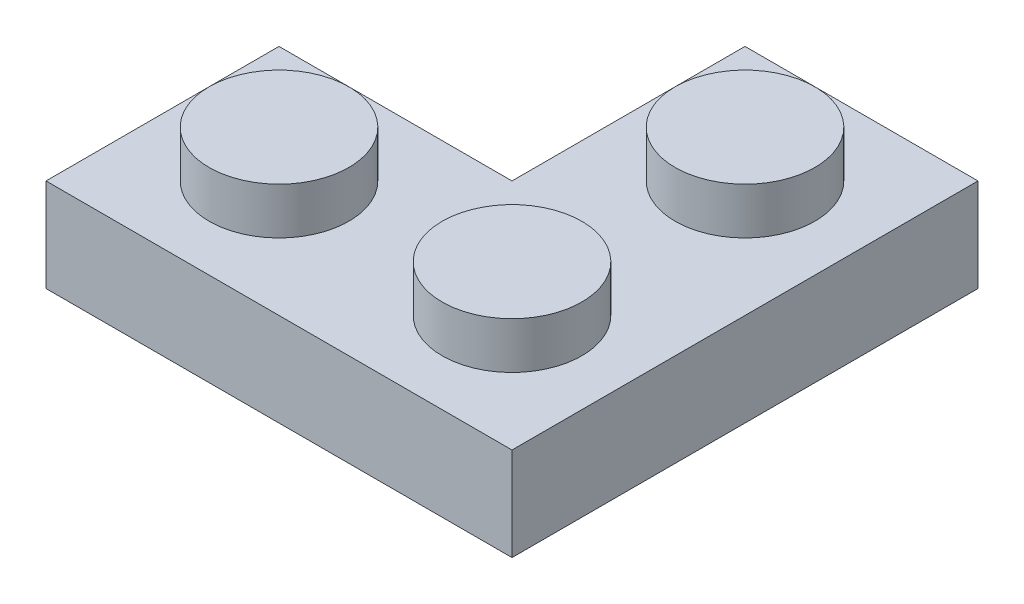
ISO-10303-21;
HEADER;
FILE_DESCRIPTION(('STEP AP214'),'2;1');
FILE_NAME('part.step','',(''),(''),'','','');
FILE_SCHEMA(('AUTOMOTIVE_DESIGN { 1 0 10303 214 1 1 1 1 }'));
ENDSEC;
DATA;
#1=APPLICATION_CONTEXT('core data for automotive mechanical design processes');
#2=APPLICATION_PROTOCOL_DEFINITION('international standard','automotive_design',2000,#1);
#3=PRODUCT_CONTEXT('',#1,'mechanical');
#4=PRODUCT('Part','Part','',(#3));
#5=PRODUCT_RELATED_PRODUCT_CATEGORY('part','',(#4));
#6=PRODUCT_DEFINITION_FORMATION('','',#4);
#7=PRODUCT_DEFINITION_CONTEXT('part definition',#1,'design');
#8=PRODUCT_DEFINITION('design','',#6,#7);
#9=PRODUCT_DEFINITION_SHAPE('','',#8);
#10=(LENGTH_UNIT() NAMED_UNIT(*) SI_UNIT(.MILLI.,.METRE.));
#11=(NAMED_UNIT(*) PLANE_ANGLE_UNIT() SI_UNIT($,.RADIAN.));
#12=(NAMED_UNIT(*) SI_UNIT($,.STERADIAN.) SOLID_ANGLE_UNIT());
#13=UNCERTAINTY_MEASURE_WITH_UNIT(LENGTH_MEASURE(1.E-05),#10,'distance_accuracy_value','');
#14=(GEOMETRIC_REPRESENTATION_CONTEXT(3) GLOBAL_UNCERTAINTY_ASSIGNED_CONTEXT((#13)) GLOBAL_UNIT_ASSIGNED_CONTEXT((#10,
#11,#12)) REPRESENTATION_CONTEXT('',''));
#15=CARTESIAN_POINT('',(0.,0.,0.));
#16=DIRECTION('',(0.,0.,1.));
#17=DIRECTION('',(1.,0.,0.));
#18=AXIS2_PLACEMENT_3D('',#15,#16,#17);
#19=CARTESIAN_POINT('',(0.,0.,-8.));
#20=DIRECTION('',(0.,-1.,0.));
#21=DIRECTION('',(0.,0.,-1.));
#22=AXIS2_PLACEMENT_3D('',#19,#20,#21);
#23=PLANE('',#22);
#24=DIRECTION('',(1.,0.,0.));
#25=VECTOR('',#24,1.);
#26=CARTESIAN_POINT('',(0.,0.,0.));
#27=LINE('',#26,#25);
#28=CARTESIAN_POINT('',(0.,0.,0.));
#29=VERTEX_POINT('',#28);
#30=CARTESIAN_POINT('',(16.,0.,0.));
#31=VERTEX_POINT('',#30);
#32=EDGE_CURVE('E247',#29,#31,#27,.T.);
#33=ORIENTED_EDGE('',*,*,#32,.F.);
#34=DIRECTION('',(0.,0.,1.));
#35=VECTOR('',#34,1.);
#36=CARTESIAN_POINT('',(0.,0.,-8.));
#37=LINE('',#36,#35);
#38=CARTESIAN_POINT('',(0.,0.,-8.));
#39=VERTEX_POINT('',#38);
#40=EDGE_CURVE('E244',#39,#29,#37,.T.);
#41=ORIENTED_EDGE('',*,*,#40,.F.);
#42=DIRECTION('',(1.,0.,0.));
#43=VECTOR('',#42,1.);
#44=CARTESIAN_POINT('',(0.,0.,-8.));
#45=LINE('',#44,#43);
#46=CARTESIAN_POINT('',(8.,0.,-8.));
#47=VERTEX_POINT('',#46);
#48=EDGE_CURVE('E238',#39,#47,#45,.T.);
#49=ORIENTED_EDGE('',*,*,#48,.T.);
#50=DIRECTION('',(0.,0.,-1.));
#51=VECTOR('',#50,1.);
#52=CARTESIAN_POINT('',(8.,0.,-8.));
#53=LINE('',#52,#51);
#54=CARTESIAN_POINT('',(8.,0.,-16.));
#55=VERTEX_POINT('',#54);
#56=EDGE_CURVE('E61',#47,#55,#53,.T.);
#57=ORIENTED_EDGE('',*,*,#56,.T.);
#58=DIRECTION('',(1.,0.,0.));
#59=VECTOR('',#58,1.);
#60=CARTESIAN_POINT('',(8.,0.,-16.));
#61=LINE('',#60,#59);
#62=CARTESIAN_POINT('',(16.,0.,-16.));
#63=VERTEX_POINT('',#62);
#64=EDGE_CURVE('E226',#55,#63,#61,.T.);
#65=ORIENTED_EDGE('',*,*,#64,.T.);
#66=DIRECTION('',(0.,0.,1.));
#67=VECTOR('',#66,1.);
#68=CARTESIAN_POINT('',(16.,0.,-8.));
#69=LINE('',#68,#67);
#70=EDGE_CURVE('E259',#63,#31,#69,.T.);
#71=ORIENTED_EDGE('',*,*,#70,.T.);
#72=EDGE_LOOP('',(#33,#41,#49,#57,#65,#71));
#73=FACE_BOUND('',#72,.T.);
#74=DIRECTION('',(0.,0.,1.));
#75=VECTOR('',#74,1.);
#76=CARTESIAN_POINT('',(1.6,0.,-8.));
#77=LINE('',#76,#75);
#78=CARTESIAN_POINT('',(1.6,0.,-6.4));
#79=VERTEX_POINT('',#78);
#80=CARTESIAN_POINT('',(1.6,0.,-1.6));
#81=VERTEX_POINT('',#80);
#82=EDGE_CURVE('E172',#79,#81,#77,.T.);
#83=ORIENTED_EDGE('',*,*,#82,.T.);
#84=DIRECTION('',(1.,0.,0.));
#85=VECTOR('',#84,1.);
#86=CARTESIAN_POINT('',(0.,0.,-1.6));
#87=LINE('',#86,#85);
#88=CARTESIAN_POINT('',(14.4,0.,-1.6));
#89=VERTEX_POINT('',#88);
#90=EDGE_CURVE('E148',#81,#89,#87,.T.);
#91=ORIENTED_EDGE('',*,*,#90,.T.);
#92=DIRECTION('',(0.,0.,1.));
#93=VECTOR('',#92,1.);
#94=CARTESIAN_POINT('',(14.4,0.,-8.));
#95=LINE('',#94,#93);
#96=CARTESIAN_POINT('',(14.4,0.,-14.4));
#97=VERTEX_POINT('',#96);
#98=EDGE_CURVE('E164',#97,#89,#95,.T.);
#99=ORIENTED_EDGE('',*,*,#98,.F.);
#100=DIRECTION('',(1.,0.,0.));
#101=VECTOR('',#100,1.);
#102=CARTESIAN_POINT('',(0.,0.,-14.4));
#103=LINE('',#102,#101);
#104=CARTESIAN_POINT('',(9.6,0.,-14.4));
#105=VERTEX_POINT('',#104);
#106=EDGE_CURVE('E166',#105,#97,#103,.T.);
#107=ORIENTED_EDGE('',*,*,#106,.F.);
#108=DIRECTION('',(0.,0.,-1.));
#109=VECTOR('',#108,1.);
#110=CARTESIAN_POINT('',(9.6,0.,0.));
#111=LINE('',#110,#109);
#112=CARTESIAN_POINT('',(9.6,0.,-6.4));
#113=VERTEX_POINT('',#112);
#114=EDGE_CURVE('E179',#113,#105,#111,.T.);
#115=ORIENTED_EDGE('',*,*,#114,.F.);
#116=DIRECTION('',(1.,0.,0.));
#117=VECTOR('',#116,1.);
#118=CARTESIAN_POINT('',(0.,0.,-6.4));
#119=LINE('',#118,#117);
#120=EDGE_CURVE('E156',#79,#113,#119,.T.);
#121=ORIENTED_EDGE('',*,*,#120,.F.);
#122=EDGE_LOOP('',(#83,#91,#99,#107,#115,#121));
#123=FACE_BOUND('',#122,.T.);
#124=ADVANCED_FACE('F38',(#73,#123),#23,.T.);
#125=CARTESIAN_POINT('',(0.,3.2,-8.));
#126=DIRECTION('',(-1.,0.,0.));
#127=DIRECTION('',(0.,0.,1.));
#128=AXIS2_PLACEMENT_3D('',#125,#126,#127);
#129=PLANE('',#128);
#130=DIRECTION('',(0.,-1.,0.));
#131=VECTOR('',#130,1.);
#132=CARTESIAN_POINT('',(0.,3.2,0.));
#133=LINE('',#132,#131);
#134=CARTESIAN_POINT('',(0.,3.2,0.));
#135=VERTEX_POINT('',#134);
#136=EDGE_CURVE('E232',#135,#29,#133,.T.);
#137=ORIENTED_EDGE('',*,*,#136,.F.);
#138=DIRECTION('',(0.,0.,1.));
#139=VECTOR('',#138,1.);
#140=CARTESIAN_POINT('',(0.,3.2,-8.));
#141=LINE('',#140,#139);
#142=CARTESIAN_POINT('',(0.,3.2,-8.));
#143=VERTEX_POINT('',#142);
#144=EDGE_CURVE('E255',#143,#135,#141,.T.);
#145=ORIENTED_EDGE('',*,*,#144,.F.);
#146=DIRECTION('',(0.,-1.,0.));
#147=VECTOR('',#146,1.);
#148=CARTESIAN_POINT('',(0.,3.2,-8.));
#149=LINE('',#148,#147);
#150=EDGE_CURVE('E235',#143,#39,#149,.T.);
#151=ORIENTED_EDGE('',*,*,#150,.T.);
#152=ORIENTED_EDGE('',*,*,#40,.T.);
#153=EDGE_LOOP('',(#137,#145,#151,#152));
#154=FACE_BOUND('',#153,.T.);
#155=ADVANCED_FACE('F40',(#154),#129,.T.);
#156=CARTESIAN_POINT('',(16.,3.2,-8.));
#157=DIRECTION('',(0.,1.,0.));
#158=DIRECTION('',(-1.,0.,0.));
#159=AXIS2_PLACEMENT_3D('',#156,#157,#158);
#160=PLANE('',#159);
#161=CARTESIAN_POINT('',(4.,3.2,-4.));
#162=DIRECTION('',(0.,1.,0.));
#163=DIRECTION('',(-1.,0.,0.));
#164=AXIS2_PLACEMENT_3D('',#161,#162,#163);
#165=CIRCLE('',#164,2.4);
#166=CARTESIAN_POINT('',(1.6,3.2,-4.));
#167=VERTEX_POINT('',#166);
#168=EDGE_CURVE('E139',#167,#167,#165,.T.);
#169=ORIENTED_EDGE('',*,*,#168,.F.);
#170=EDGE_LOOP('',(#169));
#171=FACE_BOUND('',#170,.T.);
#172=CARTESIAN_POINT('',(12.,3.2,-4.));
#173=DIRECTION('',(0.,1.,0.));
#174=DIRECTION('',(-1.,0.,0.));
#175=AXIS2_PLACEMENT_3D('',#172,#173,#174);
#176=CIRCLE('',#175,2.4);
#177=CARTESIAN_POINT('',(9.6,3.2,-4.));
#178=VERTEX_POINT('',#177);
#179=EDGE_CURVE('E202',#178,#178,#176,.T.);
#180=ORIENTED_EDGE('',*,*,#179,.F.);
#181=EDGE_LOOP('',(#180));
#182=FACE_BOUND('',#181,.T.);
#183=CARTESIAN_POINT('',(12.,3.2,-12.));
#184=DIRECTION('',(0.,1.,0.));
#185=DIRECTION('',(-1.,0.,0.));
#186=AXIS2_PLACEMENT_3D('',#183,#184,#185);
#187=CIRCLE('',#186,2.4);
#188=CARTESIAN_POINT('',(9.6,3.2,-12.));
#189=VERTEX_POINT('',#188);
#190=EDGE_CURVE('E208',#189,#189,#187,.T.);
#191=ORIENTED_EDGE('',*,*,#190,.F.);
#192=EDGE_LOOP('',(#191));
#193=FACE_BOUND('',#192,.T.);
#194=DIRECTION('',(-1.,0.,0.));
#195=VECTOR('',#194,1.);
#196=CARTESIAN_POINT('',(16.,3.2,0.));
#197=LINE('',#196,#195);
#198=CARTESIAN_POINT('',(16.,3.2,0.));
#199=VERTEX_POINT('',#198);
#200=EDGE_CURVE('E239',#199,#135,#197,.T.);
#201=ORIENTED_EDGE('',*,*,#200,.F.);
#202=DIRECTION('',(0.,0.,1.));
#203=VECTOR('',#202,1.);
#204=CARTESIAN_POINT('',(16.,3.2,-8.));
#205=LINE('',#204,#203);
#206=CARTESIAN_POINT('',(16.,3.2,-16.));
#207=VERTEX_POINT('',#206);
#208=EDGE_CURVE('E257',#207,#199,#205,.T.);
#209=ORIENTED_EDGE('',*,*,#208,.F.);
#210=DIRECTION('',(1.,0.,0.));
#211=VECTOR('',#210,1.);
#212=CARTESIAN_POINT('',(8.,3.2,-16.));
#213=LINE('',#212,#211);
#214=CARTESIAN_POINT('',(8.,3.2,-16.));
#215=VERTEX_POINT('',#214);
#216=EDGE_CURVE('E229',#215,#207,#213,.T.);
#217=ORIENTED_EDGE('',*,*,#216,.F.);
#218=DIRECTION('',(0.,0.,1.));
#219=VECTOR('',#218,1.);
#220=CARTESIAN_POINT('',(8.,3.2,-8.));
#221=LINE('',#220,#219);
#222=CARTESIAN_POINT('',(8.,3.2,-8.));
#223=VERTEX_POINT('',#222);
#224=EDGE_CURVE('E223',#215,#223,#221,.T.);
#225=ORIENTED_EDGE('',*,*,#224,.T.);
#226=DIRECTION('',(-1.,0.,0.));
#227=VECTOR('',#226,1.);
#228=CARTESIAN_POINT('',(16.,3.2,-8.));
#229=LINE('',#228,#227);
#230=EDGE_CURVE('E242',#223,#143,#229,.T.);
#231=ORIENTED_EDGE('',*,*,#230,.T.);
#232=ORIENTED_EDGE('',*,*,#144,.T.);
#233=EDGE_LOOP('',(#201,#209,#217,#225,#231,#232));
#234=FACE_BOUND('',#233,.T.);
#235=ADVANCED_FACE('F301',(#171,#182,#193,#234),#160,.T.);
#236=CARTESIAN_POINT('',(16.,0.,-8.));
#237=DIRECTION('',(1.,0.,0.));
#238=DIRECTION('',(0.,0.,-1.));
#239=AXIS2_PLACEMENT_3D('',#236,#237,#238);
#240=PLANE('',#239);
#241=DIRECTION('',(0.,1.,0.));
#242=VECTOR('',#241,1.);
#243=CARTESIAN_POINT('',(16.,0.,0.));
#244=LINE('',#243,#242);
#245=EDGE_CURVE('E250',#31,#199,#244,.T.);
#246=ORIENTED_EDGE('',*,*,#245,.F.);
#247=ORIENTED_EDGE('',*,*,#70,.F.);
#248=DIRECTION('',(0.,1.,0.));
#249=VECTOR('',#248,1.);
#250=CARTESIAN_POINT('',(16.,0.,-16.));
#251=LINE('',#250,#249);
#252=EDGE_CURVE('E214',#63,#207,#251,.T.);
#253=ORIENTED_EDGE('',*,*,#252,.T.);
#254=ORIENTED_EDGE('',*,*,#208,.T.);
#255=EDGE_LOOP('',(#246,#247,#253,#254));
#256=FACE_BOUND('',#255,.T.);
#257=ADVANCED_FACE('F306',(#256),#240,.T.);
#258=CARTESIAN_POINT('',(0.,0.,-8.));
#259=DIRECTION('',(0.,0.,1.));
#260=DIRECTION('',(1.,0.,0.));
#261=AXIS2_PLACEMENT_3D('',#258,#259,#260);
#262=PLANE('',#261);
#263=ORIENTED_EDGE('',*,*,#230,.F.);
#264=DIRECTION('',(0.,-1.,0.));
#265=VECTOR('',#264,1.);
#266=CARTESIAN_POINT('',(8.,3.2,-8.));
#267=LINE('',#266,#265);
#268=EDGE_CURVE('E217',#223,#47,#267,.T.);
#269=ORIENTED_EDGE('',*,*,#268,.T.);
#270=ORIENTED_EDGE('',*,*,#48,.F.);
#271=ORIENTED_EDGE('',*,*,#150,.F.);
#272=EDGE_LOOP('',(#263,#269,#270,#271));
#273=FACE_BOUND('',#272,.T.);
#274=ADVANCED_FACE('F309',(#273),#262,.F.);
#275=CARTESIAN_POINT('',(0.,0.,0.));
#276=DIRECTION('',(0.,0.,1.));
#277=DIRECTION('',(1.,0.,0.));
#278=AXIS2_PLACEMENT_3D('',#275,#276,#277);
#279=PLANE('',#278);
#280=ORIENTED_EDGE('',*,*,#136,.T.);
#281=ORIENTED_EDGE('',*,*,#32,.T.);
#282=ORIENTED_EDGE('',*,*,#245,.T.);
#283=ORIENTED_EDGE('',*,*,#200,.T.);
#284=EDGE_LOOP('',(#280,#281,#282,#283));
#285=FACE_BOUND('',#284,.T.);
#286=ADVANCED_FACE('F314',(#285),#279,.T.);
#287=CARTESIAN_POINT('',(8.,0.,-16.));
#288=DIRECTION('',(0.,0.,-1.));
#289=DIRECTION('',(-1.,0.,0.));
#290=AXIS2_PLACEMENT_3D('',#287,#288,#289);
#291=PLANE('',#290);
#292=ORIENTED_EDGE('',*,*,#252,.F.);
#293=ORIENTED_EDGE('',*,*,#64,.F.);
#294=DIRECTION('',(0.,1.,0.));
#295=VECTOR('',#294,1.);
#296=CARTESIAN_POINT('',(8.,0.,-16.));
#297=LINE('',#296,#295);
#298=EDGE_CURVE('E220',#55,#215,#297,.T.);
#299=ORIENTED_EDGE('',*,*,#298,.T.);
#300=ORIENTED_EDGE('',*,*,#216,.T.);
#301=EDGE_LOOP('',(#292,#293,#299,#300));
#302=FACE_BOUND('',#301,.T.);
#303=ADVANCED_FACE('F317',(#302),#291,.T.);
#304=CARTESIAN_POINT('',(8.,0.,0.));
#305=DIRECTION('',(1.,0.,0.));
#306=DIRECTION('',(0.,0.,-1.));
#307=AXIS2_PLACEMENT_3D('',#304,#305,#306);
#308=PLANE('',#307);
#309=ORIENTED_EDGE('',*,*,#268,.F.);
#310=ORIENTED_EDGE('',*,*,#224,.F.);
#311=ORIENTED_EDGE('',*,*,#298,.F.);
#312=ORIENTED_EDGE('',*,*,#56,.F.);
#313=EDGE_LOOP('',(#309,#310,#311,#312));
#314=FACE_BOUND('',#313,.T.);
#315=ADVANCED_FACE('F324',(#314),#308,.F.);
#316=CARTESIAN_POINT('',(12.,4.8,-12.));
#317=DIRECTION('',(0.,-1.,0.));
#318=DIRECTION('',(1.,0.,0.));
#319=AXIS2_PLACEMENT_3D('',#316,#317,#318);
#320=CYLINDRICAL_SURFACE('',#319,2.4);
#321=CARTESIAN_POINT('',(12.,4.8,-12.));
#322=DIRECTION('',(0.,1.,0.));
#323=DIRECTION('',(-1.,0.,0.));
#324=AXIS2_PLACEMENT_3D('',#321,#322,#323);
#325=CIRCLE('',#324,2.4);
#326=CARTESIAN_POINT('',(9.6,4.8,-12.));
#327=VERTEX_POINT('',#326);
#328=EDGE_CURVE('E211',#327,#327,#325,.T.);
#329=ORIENTED_EDGE('',*,*,#328,.F.);
#330=EDGE_LOOP('',(#329));
#331=FACE_BOUND('',#330,.T.);
#332=ORIENTED_EDGE('',*,*,#190,.T.);
#333=EDGE_LOOP('',(#332));
#334=FACE_BOUND('',#333,.T.);
#335=ADVANCED_FACE('F328',(#331,#334),#320,.T.);
#336=CARTESIAN_POINT('',(12.,4.8,-12.));
#337=DIRECTION('',(0.,1.,0.));
#338=DIRECTION('',(-1.,0.,0.));
#339=AXIS2_PLACEMENT_3D('',#336,#337,#338);
#340=PLANE('',#339);
#341=ORIENTED_EDGE('',*,*,#328,.T.);
#342=EDGE_LOOP('',(#341));
#343=FACE_BOUND('',#342,.T.);
#344=ADVANCED_FACE('F331',(#343),#340,.T.);
#345=CARTESIAN_POINT('',(12.,4.8,-4.));
#346=DIRECTION('',(0.,-1.,0.));
#347=DIRECTION('',(1.,0.,0.));
#348=AXIS2_PLACEMENT_3D('',#345,#346,#347);
#349=CYLINDRICAL_SURFACE('',#348,2.4);
#350=CARTESIAN_POINT('',(12.,4.8,-4.));
#351=DIRECTION('',(0.,1.,0.));
#352=DIRECTION('',(-1.,0.,0.));
#353=AXIS2_PLACEMENT_3D('',#350,#351,#352);
#354=CIRCLE('',#353,2.4);
#355=CARTESIAN_POINT('',(9.6,4.8,-4.));
#356=VERTEX_POINT('',#355);
#357=EDGE_CURVE('E205',#356,#356,#354,.T.);
#358=ORIENTED_EDGE('',*,*,#357,.F.);
#359=EDGE_LOOP('',(#358));
#360=FACE_BOUND('',#359,.T.);
#361=ORIENTED_EDGE('',*,*,#179,.T.);
#362=EDGE_LOOP('',(#361));
#363=FACE_BOUND('',#362,.T.);
#364=ADVANCED_FACE('F335',(#360,#363),#349,.T.);
#365=CARTESIAN_POINT('',(12.,4.8,-4.));
#366=DIRECTION('',(0.,1.,0.));
#367=DIRECTION('',(-1.,0.,0.));
#368=AXIS2_PLACEMENT_3D('',#365,#366,#367);
#369=PLANE('',#368);
#370=ORIENTED_EDGE('',*,*,#357,.T.);
#371=EDGE_LOOP('',(#370));
#372=FACE_BOUND('',#371,.T.);
#373=ADVANCED_FACE('F339',(#372),#369,.T.);
#374=CARTESIAN_POINT('',(4.,4.8,-4.));
#375=DIRECTION('',(0.,-1.,0.));
#376=DIRECTION('',(1.,0.,0.));
#377=AXIS2_PLACEMENT_3D('',#374,#375,#376);
#378=CYLINDRICAL_SURFACE('',#377,2.4);
#379=CARTESIAN_POINT('',(4.,4.8,-4.));
#380=DIRECTION('',(0.,1.,0.));
#381=DIRECTION('',(-1.,0.,0.));
#382=AXIS2_PLACEMENT_3D('',#379,#380,#381);
#383=CIRCLE('',#382,2.4);
#384=CARTESIAN_POINT('',(1.6,4.8,-4.));
#385=VERTEX_POINT('',#384);
#386=EDGE_CURVE('E199',#385,#385,#383,.T.);
#387=ORIENTED_EDGE('',*,*,#386,.F.);
#388=EDGE_LOOP('',(#387));
#389=FACE_BOUND('',#388,.T.);
#390=ORIENTED_EDGE('',*,*,#168,.T.);
#391=EDGE_LOOP('',(#390));
#392=FACE_BOUND('',#391,.T.);
#393=ADVANCED_FACE('F343',(#389,#392),#378,.T.);
#394=CARTESIAN_POINT('',(4.,4.8,-4.));
#395=DIRECTION('',(0.,1.,0.));
#396=DIRECTION('',(-1.,0.,0.));
#397=AXIS2_PLACEMENT_3D('',#394,#395,#396);
#398=PLANE('',#397);
#399=ORIENTED_EDGE('',*,*,#386,.T.);
#400=EDGE_LOOP('',(#399));
#401=FACE_BOUND('',#400,.T.);
#402=ADVANCED_FACE('F347',(#401),#398,.T.);
#403=CARTESIAN_POINT('',(1.6,3.2,-8.));
#404=DIRECTION('',(-1.,0.,0.));
#405=DIRECTION('',(0.,0.,1.));
#406=AXIS2_PLACEMENT_3D('',#403,#404,#405);
#407=PLANE('',#406);
#408=DIRECTION('',(0.,-1.,0.));
#409=VECTOR('',#408,1.);
#410=CARTESIAN_POINT('',(1.6,0.,-1.6));
#411=LINE('',#410,#409);
#412=CARTESIAN_POINT('',(1.6,1.6,-1.6));
#413=VERTEX_POINT('',#412);
#414=EDGE_CURVE('E132',#413,#81,#411,.T.);
#415=ORIENTED_EDGE('',*,*,#414,.T.);
#416=ORIENTED_EDGE('',*,*,#82,.F.);
#417=DIRECTION('',(0.,-1.,0.));
#418=VECTOR('',#417,1.);
#419=CARTESIAN_POINT('',(1.6,0.,-6.4));
#420=LINE('',#419,#418);
#421=CARTESIAN_POINT('',(1.6,1.6,-6.4));
#422=VERTEX_POINT('',#421);
#423=EDGE_CURVE('E135',#422,#79,#420,.T.);
#424=ORIENTED_EDGE('',*,*,#423,.F.);
#425=DIRECTION('',(0.,0.,1.));
#426=VECTOR('',#425,1.);
#427=CARTESIAN_POINT('',(1.6,1.6,-8.));
#428=LINE('',#427,#426);
#429=EDGE_CURVE('E129',#422,#413,#428,.T.);
#430=ORIENTED_EDGE('',*,*,#429,.T.);
#431=EDGE_LOOP('',(#415,#416,#424,#430));
#432=FACE_BOUND('',#431,.T.);
#433=ADVANCED_FACE('F131',(#432),#407,.F.);
#434=CARTESIAN_POINT('',(16.,1.6,-8.));
#435=DIRECTION('',(0.,1.,0.));
#436=DIRECTION('',(-1.,0.,0.));
#437=AXIS2_PLACEMENT_3D('',#434,#435,#436);
#438=PLANE('',#437);
#439=CARTESIAN_POINT('',(12.,1.6,-8.));
#440=DIRECTION('',(0.,1.,0.));
#441=DIRECTION('',(-1.,0.,0.));
#442=AXIS2_PLACEMENT_3D('',#439,#440,#441);
#443=CIRCLE('',#442,1.77);
#444=CARTESIAN_POINT('',(10.23,1.6,-8.));
#445=VERTEX_POINT('',#444);
#446=EDGE_CURVE('E11',#445,#445,#443,.F.);
#447=ORIENTED_EDGE('',*,*,#446,.F.);
#448=EDGE_LOOP('',(#447));
#449=FACE_BOUND('',#448,.T.);
#450=CARTESIAN_POINT('',(8.,1.6,-4.));
#451=DIRECTION('',(0.,1.,0.));
#452=DIRECTION('',(-1.,0.,0.));
#453=AXIS2_PLACEMENT_3D('',#450,#451,#452);
#454=CIRCLE('',#453,1.77);
#455=CARTESIAN_POINT('',(6.23,1.6,-4.));
#456=VERTEX_POINT('',#455);
#457=EDGE_CURVE('E46',#456,#456,#454,.F.);
#458=ORIENTED_EDGE('',*,*,#457,.F.);
#459=EDGE_LOOP('',(#458));
#460=FACE_BOUND('',#459,.T.);
#461=CARTESIAN_POINT('',(4.,1.6,-4.));
#462=DIRECTION('',(0.,1.,0.));
#463=DIRECTION('',(-1.,0.,0.));
#464=AXIS2_PLACEMENT_3D('',#461,#462,#463);
#465=CIRCLE('',#464,0.799999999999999);
#466=CARTESIAN_POINT('',(3.2,1.6,-4.));
#467=VERTEX_POINT('',#466);
#468=EDGE_CURVE('E190',#467,#467,#465,.T.);
#469=ORIENTED_EDGE('',*,*,#468,.T.);
#470=EDGE_LOOP('',(#469));
#471=FACE_BOUND('',#470,.T.);
#472=CARTESIAN_POINT('',(12.,1.6,-4.));
#473=DIRECTION('',(0.,1.,0.));
#474=DIRECTION('',(-1.,0.,0.));
#475=AXIS2_PLACEMENT_3D('',#472,#473,#474);
#476=CIRCLE('',#475,0.799999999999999);
#477=CARTESIAN_POINT('',(11.2,1.6,-4.));
#478=VERTEX_POINT('',#477);
#479=EDGE_CURVE('E186',#478,#478,#476,.T.);
#480=ORIENTED_EDGE('',*,*,#479,.T.);
#481=EDGE_LOOP('',(#480));
#482=FACE_BOUND('',#481,.T.);
#483=CARTESIAN_POINT('',(12.,1.6,-12.));
#484=DIRECTION('',(0.,1.,0.));
#485=DIRECTION('',(-1.,0.,0.));
#486=AXIS2_PLACEMENT_3D('',#483,#484,#485);
#487=CIRCLE('',#486,0.799999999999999);
#488=CARTESIAN_POINT('',(11.2,1.6,-12.));
#489=VERTEX_POINT('',#488);
#490=EDGE_CURVE('E161',#489,#489,#487,.T.);
#491=ORIENTED_EDGE('',*,*,#490,.T.);
#492=EDGE_LOOP('',(#491));
#493=FACE_BOUND('',#492,.T.);
#494=DIRECTION('',(-1.,0.,0.));
#495=VECTOR('',#494,1.);
#496=CARTESIAN_POINT('',(0.,1.6,-1.6));
#497=LINE('',#496,#495);
#498=CARTESIAN_POINT('',(14.4,1.6,-1.6));
#499=VERTEX_POINT('',#498);
#500=EDGE_CURVE('E146',#499,#413,#497,.T.);
#501=ORIENTED_EDGE('',*,*,#500,.T.);
#502=ORIENTED_EDGE('',*,*,#429,.F.);
#503=DIRECTION('',(-1.,0.,0.));
#504=VECTOR('',#503,1.);
#505=CARTESIAN_POINT('',(0.,1.6,-6.4));
#506=LINE('',#505,#504);
#507=CARTESIAN_POINT('',(9.6,1.6,-6.4));
#508=VERTEX_POINT('',#507);
#509=EDGE_CURVE('E171',#508,#422,#506,.T.);
#510=ORIENTED_EDGE('',*,*,#509,.F.);
#511=DIRECTION('',(0.,0.,1.));
#512=VECTOR('',#511,1.);
#513=CARTESIAN_POINT('',(9.6,1.6,0.));
#514=LINE('',#513,#512);
#515=CARTESIAN_POINT('',(9.6,1.6,-14.4));
#516=VERTEX_POINT('',#515);
#517=EDGE_CURVE('E167',#516,#508,#514,.T.);
#518=ORIENTED_EDGE('',*,*,#517,.F.);
#519=DIRECTION('',(1.,0.,0.));
#520=VECTOR('',#519,1.);
#521=CARTESIAN_POINT('',(8.,1.6,-14.4));
#522=LINE('',#521,#520);
#523=CARTESIAN_POINT('',(14.4,1.6,-14.4));
#524=VERTEX_POINT('',#523);
#525=EDGE_CURVE('E149',#516,#524,#522,.T.);
#526=ORIENTED_EDGE('',*,*,#525,.T.);
#527=DIRECTION('',(0.,0.,1.));
#528=VECTOR('',#527,1.);
#529=CARTESIAN_POINT('',(14.4,1.6,-8.));
#530=LINE('',#529,#528);
#531=EDGE_CURVE('E140',#524,#499,#530,.T.);
#532=ORIENTED_EDGE('',*,*,#531,.T.);
#533=EDGE_LOOP('',(#501,#502,#510,#518,#526,#532));
#534=FACE_BOUND('',#533,.T.);
#535=ADVANCED_FACE('F151',(#449,#460,#471,#482,#493,#534),#438,.F.);
#536=CARTESIAN_POINT('',(14.4,0.,-8.));
#537=DIRECTION('',(1.,0.,0.));
#538=DIRECTION('',(0.,0.,-1.));
#539=AXIS2_PLACEMENT_3D('',#536,#537,#538);
#540=PLANE('',#539);
#541=DIRECTION('',(0.,1.,0.));
#542=VECTOR('',#541,1.);
#543=CARTESIAN_POINT('',(14.4,0.,-1.6));
#544=LINE('',#543,#542);
#545=EDGE_CURVE('E154',#89,#499,#544,.T.);
#546=ORIENTED_EDGE('',*,*,#545,.T.);
#547=ORIENTED_EDGE('',*,*,#531,.F.);
#548=DIRECTION('',(0.,1.,0.));
#549=VECTOR('',#548,1.);
#550=CARTESIAN_POINT('',(14.4,0.,-14.4));
#551=LINE('',#550,#549);
#552=EDGE_CURVE('E53',#97,#524,#551,.T.);
#553=ORIENTED_EDGE('',*,*,#552,.F.);
#554=ORIENTED_EDGE('',*,*,#98,.T.);
#555=EDGE_LOOP('',(#546,#547,#553,#554));
#556=FACE_BOUND('',#555,.T.);
#557=ADVANCED_FACE('F268',(#556),#540,.F.);
#558=CARTESIAN_POINT('',(0.,0.,-6.4));
#559=DIRECTION('',(0.,0.,1.));
#560=DIRECTION('',(1.,0.,0.));
#561=AXIS2_PLACEMENT_3D('',#558,#559,#560);
#562=PLANE('',#561);
#563=ORIENTED_EDGE('',*,*,#509,.T.);
#564=ORIENTED_EDGE('',*,*,#423,.T.);
#565=ORIENTED_EDGE('',*,*,#120,.T.);
#566=DIRECTION('',(0.,-1.,0.));
#567=VECTOR('',#566,1.);
#568=CARTESIAN_POINT('',(9.6,0.,-6.4));
#569=LINE('',#568,#567);
#570=EDGE_CURVE('E175',#508,#113,#569,.T.);
#571=ORIENTED_EDGE('',*,*,#570,.F.);
#572=EDGE_LOOP('',(#563,#564,#565,#571));
#573=FACE_BOUND('',#572,.T.);
#574=ADVANCED_FACE('F402',(#573),#562,.T.);
#575=CARTESIAN_POINT('',(0.,0.,-1.6));
#576=DIRECTION('',(0.,0.,1.));
#577=DIRECTION('',(1.,0.,0.));
#578=AXIS2_PLACEMENT_3D('',#575,#576,#577);
#579=PLANE('',#578);
#580=ORIENTED_EDGE('',*,*,#414,.F.);
#581=ORIENTED_EDGE('',*,*,#500,.F.);
#582=ORIENTED_EDGE('',*,*,#545,.F.);
#583=ORIENTED_EDGE('',*,*,#90,.F.);
#584=EDGE_LOOP('',(#580,#581,#582,#583));
#585=FACE_BOUND('',#584,.T.);
#586=ADVANCED_FACE('F144',(#585),#579,.F.);
#587=CARTESIAN_POINT('',(8.,0.,-14.4));
#588=DIRECTION('',(0.,0.,-1.));
#589=DIRECTION('',(-1.,0.,0.));
#590=AXIS2_PLACEMENT_3D('',#587,#588,#589);
#591=PLANE('',#590);
#592=ORIENTED_EDGE('',*,*,#552,.T.);
#593=ORIENTED_EDGE('',*,*,#525,.F.);
#594=DIRECTION('',(0.,1.,0.));
#595=VECTOR('',#594,1.);
#596=CARTESIAN_POINT('',(9.6,0.,-14.4));
#597=LINE('',#596,#595);
#598=EDGE_CURVE('E170',#105,#516,#597,.T.);
#599=ORIENTED_EDGE('',*,*,#598,.F.);
#600=ORIENTED_EDGE('',*,*,#106,.T.);
#601=EDGE_LOOP('',(#592,#593,#599,#600));
#602=FACE_BOUND('',#601,.T.);
#603=ADVANCED_FACE('F293',(#602),#591,.F.);
#604=CARTESIAN_POINT('',(9.6,0.,0.));
#605=DIRECTION('',(1.,0.,0.));
#606=DIRECTION('',(0.,0.,-1.));
#607=AXIS2_PLACEMENT_3D('',#604,#605,#606);
#608=PLANE('',#607);
#609=ORIENTED_EDGE('',*,*,#570,.T.);
#610=ORIENTED_EDGE('',*,*,#114,.T.);
#611=ORIENTED_EDGE('',*,*,#598,.T.);
#612=ORIENTED_EDGE('',*,*,#517,.T.);
#613=EDGE_LOOP('',(#609,#610,#611,#612));
#614=FACE_BOUND('',#613,.T.);
#615=ADVANCED_FACE('F283',(#614),#608,.T.);
#616=CARTESIAN_POINT('',(12.,4.8,-12.));
#617=DIRECTION('',(0.,-1.,0.));
#618=DIRECTION('',(1.,0.,0.));
#619=AXIS2_PLACEMENT_3D('',#616,#617,#618);
#620=CYLINDRICAL_SURFACE('',#619,0.799999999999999);
#621=CARTESIAN_POINT('',(12.,3.2,-12.));
#622=DIRECTION('',(0.,1.,0.));
#623=DIRECTION('',(-1.,0.,0.));
#624=AXIS2_PLACEMENT_3D('',#621,#622,#623);
#625=CIRCLE('',#624,0.799999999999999);
#626=CARTESIAN_POINT('',(11.2,3.2,-12.));
#627=VERTEX_POINT('',#626);
#628=EDGE_CURVE('E176',#627,#627,#625,.T.);
#629=ORIENTED_EDGE('',*,*,#628,.T.);
#630=EDGE_LOOP('',(#629));
#631=FACE_BOUND('',#630,.T.);
#632=ORIENTED_EDGE('',*,*,#490,.F.);
#633=EDGE_LOOP('',(#632));
#634=FACE_BOUND('',#633,.T.);
#635=ADVANCED_FACE('F280',(#631,#634),#620,.F.);
#636=CARTESIAN_POINT('',(12.,3.2,-12.));
#637=DIRECTION('',(0.,1.,0.));
#638=DIRECTION('',(-1.,0.,0.));
#639=AXIS2_PLACEMENT_3D('',#636,#637,#638);
#640=PLANE('',#639);
#641=ORIENTED_EDGE('',*,*,#628,.F.);
#642=EDGE_LOOP('',(#641));
#643=FACE_BOUND('',#642,.T.);
#644=ADVANCED_FACE('F282',(#643),#640,.F.);
#645=CARTESIAN_POINT('',(12.,4.8,-4.));
#646=DIRECTION('',(0.,-1.,0.));
#647=DIRECTION('',(1.,0.,0.));
#648=AXIS2_PLACEMENT_3D('',#645,#646,#647);
#649=CYLINDRICAL_SURFACE('',#648,0.799999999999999);
#650=CARTESIAN_POINT('',(12.,3.2,-4.));
#651=DIRECTION('',(0.,1.,0.));
#652=DIRECTION('',(-1.,0.,0.));
#653=AXIS2_PLACEMENT_3D('',#650,#651,#652);
#654=CIRCLE('',#653,0.799999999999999);
#655=CARTESIAN_POINT('',(11.2,3.2,-4.));
#656=VERTEX_POINT('',#655);
#657=EDGE_CURVE('E183',#656,#656,#654,.T.);
#658=ORIENTED_EDGE('',*,*,#657,.T.);
#659=EDGE_LOOP('',(#658));
#660=FACE_BOUND('',#659,.T.);
#661=ORIENTED_EDGE('',*,*,#479,.F.);
#662=EDGE_LOOP('',(#661));
#663=FACE_BOUND('',#662,.T.);
#664=ADVANCED_FACE('F290',(#660,#663),#649,.F.);
#665=CARTESIAN_POINT('',(12.,3.2,-4.));
#666=DIRECTION('',(0.,1.,0.));
#667=DIRECTION('',(-1.,0.,0.));
#668=AXIS2_PLACEMENT_3D('',#665,#666,#667);
#669=PLANE('',#668);
#670=ORIENTED_EDGE('',*,*,#657,.F.);
#671=EDGE_LOOP('',(#670));
#672=FACE_BOUND('',#671,.T.);
#673=ADVANCED_FACE('F359',(#672),#669,.F.);
#674=CARTESIAN_POINT('',(4.,4.8,-4.));
#675=DIRECTION('',(0.,-1.,0.));
#676=DIRECTION('',(1.,0.,0.));
#677=AXIS2_PLACEMENT_3D('',#674,#675,#676);
#678=CYLINDRICAL_SURFACE('',#677,0.799999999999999);
#679=CARTESIAN_POINT('',(4.,3.2,-4.));
#680=DIRECTION('',(0.,1.,0.));
#681=DIRECTION('',(-1.,0.,0.));
#682=AXIS2_PLACEMENT_3D('',#679,#680,#681);
#683=CIRCLE('',#682,0.799999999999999);
#684=CARTESIAN_POINT('',(3.2,3.2,-4.));
#685=VERTEX_POINT('',#684);
#686=EDGE_CURVE('E187',#685,#685,#683,.T.);
#687=ORIENTED_EDGE('',*,*,#686,.T.);
#688=EDGE_LOOP('',(#687));
#689=FACE_BOUND('',#688,.T.);
#690=ORIENTED_EDGE('',*,*,#468,.F.);
#691=EDGE_LOOP('',(#690));
#692=FACE_BOUND('',#691,.T.);
#693=ADVANCED_FACE('F355',(#689,#692),#678,.F.);
#694=CARTESIAN_POINT('',(4.,3.2,-4.));
#695=DIRECTION('',(0.,1.,0.));
#696=DIRECTION('',(-1.,0.,0.));
#697=AXIS2_PLACEMENT_3D('',#694,#695,#696);
#698=PLANE('',#697);
#699=ORIENTED_EDGE('',*,*,#686,.F.);
#700=EDGE_LOOP('',(#699));
#701=FACE_BOUND('',#700,.T.);
#702=ADVANCED_FACE('F352',(#701),#698,.F.);
#703=CARTESIAN_POINT('',(8.,0.,-4.));
#704=DIRECTION('',(0.,1.,0.));
#705=DIRECTION('',(-1.,0.,0.));
#706=AXIS2_PLACEMENT_3D('',#703,#704,#705);
#707=CYLINDRICAL_SURFACE('',#706,1.77);
#708=CARTESIAN_POINT('',(8.,0.,-4.));
#709=DIRECTION('',(0.,-1.,0.));
#710=DIRECTION('',(1.,0.,0.));
#711=AXIS2_PLACEMENT_3D('',#708,#709,#710);
#712=CIRCLE('',#711,1.77);
#713=CARTESIAN_POINT('',(9.77,0.,-4.));
#714=VERTEX_POINT('',#713);
#715=EDGE_CURVE('E371',#714,#714,#712,.T.);
#716=ORIENTED_EDGE('',*,*,#715,.F.);
#717=EDGE_LOOP('',(#716));
#718=FACE_BOUND('',#717,.T.);
#719=ORIENTED_EDGE('',*,*,#457,.T.);
#720=EDGE_LOOP('',(#719));
#721=FACE_BOUND('',#720,.T.);
#722=ADVANCED_FACE('F264',(#718,#721),#707,.T.);
#723=CARTESIAN_POINT('',(8.,0.,-4.));
#724=DIRECTION('',(0.,-1.,0.));
#725=DIRECTION('',(1.,0.,0.));
#726=AXIS2_PLACEMENT_3D('',#723,#724,#725);
#727=PLANE('',#726);
#728=ORIENTED_EDGE('',*,*,#715,.T.);
#729=EDGE_LOOP('',(#728));
#730=FACE_BOUND('',#729,.T.);
#731=ADVANCED_FACE('F384',(#730),#727,.T.);
#732=CARTESIAN_POINT('',(12.,0.,-8.));
#733=DIRECTION('',(0.,1.,0.));
#734=DIRECTION('',(-1.,0.,0.));
#735=AXIS2_PLACEMENT_3D('',#732,#733,#734);
#736=CYLINDRICAL_SURFACE('',#735,1.77);
#737=CARTESIAN_POINT('',(12.,0.,-8.));
#738=DIRECTION('',(0.,-1.,0.));
#739=DIRECTION('',(1.,0.,0.));
#740=AXIS2_PLACEMENT_3D('',#737,#738,#739);
#741=CIRCLE('',#740,1.77);
#742=CARTESIAN_POINT('',(13.77,0.,-8.));
#743=VERTEX_POINT('',#742);
#744=EDGE_CURVE('E375',#743,#743,#741,.T.);
#745=ORIENTED_EDGE('',*,*,#744,.F.);
#746=EDGE_LOOP('',(#745));
#747=FACE_BOUND('',#746,.T.);
#748=ORIENTED_EDGE('',*,*,#446,.T.);
#749=EDGE_LOOP('',(#748));
#750=FACE_BOUND('',#749,.T.);
#751=ADVANCED_FACE('F381',(#747,#750),#736,.T.);
#752=CARTESIAN_POINT('',(12.,0.,-8.));
#753=DIRECTION('',(0.,-1.,0.));
#754=DIRECTION('',(1.,0.,0.));
#755=AXIS2_PLACEMENT_3D('',#752,#753,#754);
#756=PLANE('',#755);
#757=ORIENTED_EDGE('',*,*,#744,.T.);
#758=EDGE_LOOP('',(#757));
#759=FACE_BOUND('',#758,.T.);
#760=ADVANCED_FACE('F379',(#759),#756,.T.);
#761=CLOSED_SHELL('',(#124,#155,#235,#257,#274,#286,#303,#315,#335,#344,#364,#373,#393,#402,
#433,#535,#557,#574,#586,#603,#615,#635,#644,#664,#673,#693,#702,#722,#731,#751,#760));
#762=MANIFOLD_SOLID_BREP('B2',#761);
#763=ADVANCED_BREP_SHAPE_REPRESENTATION('',(#18,#762),#14);
#764=SHAPE_DEFINITION_REPRESENTATION(#9,#763);
ENDSEC;
END-ISO-10303-21;
